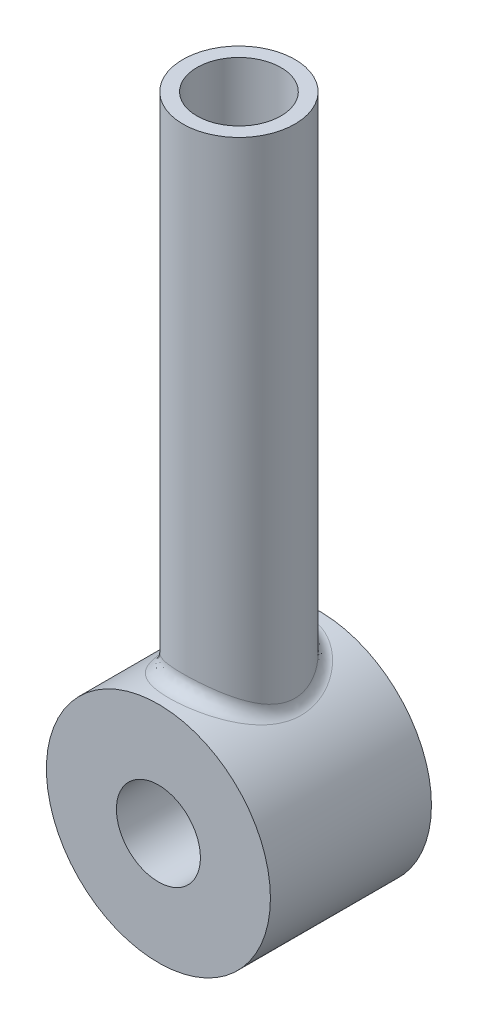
ISO-10303-21;
HEADER;
FILE_DESCRIPTION(('STEP AP214'),'2;1');
FILE_NAME('part.step','',(''),(''),'','','');
FILE_SCHEMA(('AUTOMOTIVE_DESIGN { 1 0 10303 214 1 1 1 1 }'));
ENDSEC;
DATA;
#1=APPLICATION_CONTEXT('core data for automotive mechanical design processes');
#2=APPLICATION_PROTOCOL_DEFINITION('international standard','automotive_design',2000,#1);
#3=PRODUCT_CONTEXT('',#1,'mechanical');
#4=PRODUCT('Part','Part','',(#3));
#5=PRODUCT_RELATED_PRODUCT_CATEGORY('part','',(#4));
#6=PRODUCT_DEFINITION_FORMATION('','',#4);
#7=PRODUCT_DEFINITION_CONTEXT('part definition',#1,'design');
#8=PRODUCT_DEFINITION('design','',#6,#7);
#9=PRODUCT_DEFINITION_SHAPE('','',#8);
#10=(LENGTH_UNIT() NAMED_UNIT(*) SI_UNIT(.MILLI.,.METRE.));
#11=(NAMED_UNIT(*) PLANE_ANGLE_UNIT() SI_UNIT($,.RADIAN.));
#12=(NAMED_UNIT(*) SI_UNIT($,.STERADIAN.) SOLID_ANGLE_UNIT());
#13=UNCERTAINTY_MEASURE_WITH_UNIT(LENGTH_MEASURE(1.E-05),#10,'distance_accuracy_value','');
#14=(GEOMETRIC_REPRESENTATION_CONTEXT(3) GLOBAL_UNCERTAINTY_ASSIGNED_CONTEXT((#13)) GLOBAL_UNIT_ASSIGNED_CONTEXT((#10,
#11,#12)) REPRESENTATION_CONTEXT('',''));
#15=CARTESIAN_POINT('',(0.,0.,0.));
#16=DIRECTION('',(0.,0.,1.));
#17=DIRECTION('',(1.,0.,0.));
#18=AXIS2_PLACEMENT_3D('',#15,#16,#17);
#19=CARTESIAN_POINT('',(0.,0.,11.5));
#20=DIRECTION('',(0.,0.,-1.));
#21=DIRECTION('',(-1.,0.,0.));
#22=AXIS2_PLACEMENT_3D('',#19,#20,#21);
#23=CYLINDRICAL_SURFACE('',#22,8.);
#24=CARTESIAN_POINT('',(-1.75121556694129,7.80597489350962,1.15449817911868));
#25=CARTESIAN_POINT('',(-1.40586063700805,7.88345284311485,2.00061853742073));
#26=CARTESIAN_POINT('',(-1.57609401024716,8.78172175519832,2.07359854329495));
#27=CARTESIAN_POINT('',(-1.63424459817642,7.83222354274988,1.09807547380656));
#28=CARTESIAN_POINT('',(-1.30540557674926,7.90053171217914,1.96335306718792));
#29=CARTESIAN_POINT('',(-1.47082013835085,8.81125148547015,2.02846037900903));
#30=CARTESIAN_POINT('',(-1.51475217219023,7.85626016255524,1.04714375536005));
#31=CARTESIAN_POINT('',(-1.20508992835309,7.91558956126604,1.93076368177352));
#32=CARTESIAN_POINT('',(-1.36327695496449,8.83829268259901,1.98771500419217));
#33=CARTESIAN_POINT('',(-1.27150965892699,7.89927045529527,0.956823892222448));
#34=CARTESIAN_POINT('',(-1.00382958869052,7.94199875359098,1.87385027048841));
#35=CARTESIAN_POINT('',(-1.14435869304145,8.88667926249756,1.91545911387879));
#36=CARTESIAN_POINT('',(-1.14776183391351,7.91824677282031,0.91742971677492));
#37=CARTESIAN_POINT('',(-0.903074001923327,7.95329276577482,1.84965217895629));
#38=CARTESIAN_POINT('',(-1.03298565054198,8.90802762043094,1.88394377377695));
#39=CARTESIAN_POINT('',(-0.897066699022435,7.95054890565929,0.85076612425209));
#40=CARTESIAN_POINT('',(-0.701402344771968,7.97222130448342,1.80917420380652));
#41=CARTESIAN_POINT('',(-0.807360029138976,8.94436751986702,1.83061289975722));
#42=CARTESIAN_POINT('',(-0.770121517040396,7.96387837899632,0.823488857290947));
#43=CARTESIAN_POINT('',(-0.600720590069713,7.97981035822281,1.79299215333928));
#44=CARTESIAN_POINT('',(-0.693109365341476,8.95936317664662,1.80879108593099));
#45=CARTESIAN_POINT('',(-0.514166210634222,7.98449473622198,0.781437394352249));
#46=CARTESIAN_POINT('',(-0.399295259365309,7.9914440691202,1.76820406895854));
#47=CARTESIAN_POINT('',(-0.462749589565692,8.98255657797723,1.77514991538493));
#48=CARTESIAN_POINT('',(-0.385156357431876,7.99178240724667,0.766661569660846));
#49=CARTESIAN_POINT('',(-0.298817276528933,7.99545757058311,1.75966452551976));
#50=CARTESIAN_POINT('',(-0.346640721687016,8.99075520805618,1.76332925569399));
#51=CARTESIAN_POINT('',(-0.0282131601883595,8.00317024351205,0.74355654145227));
#52=CARTESIAN_POINT('',(-0.0213022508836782,8.00178070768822,1.74621063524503));
#53=CARTESIAN_POINT('',(-0.0253918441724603,9.00356652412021,1.74484523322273));
#54=CARTESIAN_POINT('',(0.200763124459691,8.00069409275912,0.748548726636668));
#55=CARTESIAN_POINT('',(0.154624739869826,8.00045286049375,1.74903568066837));
#56=CARTESIAN_POINT('',(0.180686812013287,9.00078085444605,1.74883898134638));
#57=CARTESIAN_POINT('',(0.654139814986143,7.9764502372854,0.797808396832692));
#58=CARTESIAN_POINT('',(0.508496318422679,7.98693862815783,1.7777943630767));
#59=CARTESIAN_POINT('',(0.588725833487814,8.97350651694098,1.78824671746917));
#60=CARTESIAN_POINT('',(0.878540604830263,7.95468415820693,0.842072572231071));
#61=CARTESIAN_POINT('',(0.684920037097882,7.97486918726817,1.80347913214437));
#62=CARTESIAN_POINT('',(0.790686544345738,8.94901967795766,1.82365805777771));
#63=CARTESIAN_POINT('',(1.30918297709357,7.89504509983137,0.965527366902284));
#64=CARTESIAN_POINT('',(1.03325415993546,7.93958897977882,1.87900426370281));
#65=CARTESIAN_POINT('',(1.17826467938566,8.88192573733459,1.92242189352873));
#66=CARTESIAN_POINT('',(1.51578048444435,7.85773293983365,1.04350515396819));
#67=CARTESIAN_POINT('',(1.20390955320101,7.91702207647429,1.92745269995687));
#68=CARTESIAN_POINT('',(1.36420243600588,8.83994955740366,1.98480412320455));
#69=CARTESIAN_POINT('',(1.91433299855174,7.77026506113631,1.23103750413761));
#70=CARTESIAN_POINT('',(1.54314623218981,7.86073565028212,2.05011561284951));
#71=CARTESIAN_POINT('',(1.72289969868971,8.74154819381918,2.13483000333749));
#72=CARTESIAN_POINT('',(2.10628510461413,7.72010680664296,1.34059830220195));
#73=CARTESIAN_POINT('',(1.7110270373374,7.82733048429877,2.12361983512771));
#74=CARTESIAN_POINT('',(1.89565659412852,8.68512015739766,2.22247864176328));
#75=CARTESIAN_POINT('',(2.4881309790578,7.60606729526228,1.59874832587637));
#76=CARTESIAN_POINT('',(2.05378499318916,7.7472923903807,2.30464273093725));
#77=CARTESIAN_POINT('',(2.2393178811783,8.55682570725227,2.42899866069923));
#78=CARTESIAN_POINT('',(2.67641438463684,7.5413748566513,1.74989151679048));
#79=CARTESIAN_POINT('',(2.22806395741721,7.70004157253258,2.41382660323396));
#80=CARTESIAN_POINT('',(2.40877294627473,8.48404671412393,2.54991321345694));
#81=CARTESIAN_POINT('',(3.02903905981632,7.40679563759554,2.0819194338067));
#82=CARTESIAN_POINT('',(2.56175098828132,7.59732827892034,2.66310862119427));
#83=CARTESIAN_POINT('',(2.72613515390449,8.33264509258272,2.81553554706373));
#84=CARTESIAN_POINT('',(3.19335692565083,7.33690387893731,2.26283287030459));
#85=CARTESIAN_POINT('',(2.72143820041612,7.54205580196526,2.80250864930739));
#86=CARTESIAN_POINT('',(2.87402123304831,8.254016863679,2.96026629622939));
#87=CARTESIAN_POINT('',(3.51282681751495,7.18988022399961,2.67347521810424));
#88=CARTESIAN_POINT('',(3.03614005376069,7.42235039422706,3.12743226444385));
#89=CARTESIAN_POINT('',(3.16154413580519,8.08861525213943,3.2887801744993));
#90=CARTESIAN_POINT('',(3.66476839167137,7.11283688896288,2.90642273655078));
#91=CARTESIAN_POINT('',(3.18985021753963,7.35739066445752,3.31637407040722));
#92=CARTESIAN_POINT('',(3.29829155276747,8.00194150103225,3.47513818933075));
#93=CARTESIAN_POINT('',(3.93190755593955,6.96872958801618,3.40113730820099));
#94=CARTESIAN_POINT('',(3.46227094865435,7.23350675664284,3.72576304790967));
#95=CARTESIAN_POINT('',(3.5387168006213,7.83982078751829,3.87090984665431));
#96=CARTESIAN_POINT('',(4.04713349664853,6.90165794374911,3.66288191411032));
#97=CARTESIAN_POINT('',(3.58224456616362,7.17421234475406,3.94637069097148));
#98=CARTESIAN_POINT('',(3.64242014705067,7.76436518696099,4.08030553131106));
#99=CARTESIAN_POINT('',(4.21963933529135,6.79727736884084,4.16145951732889));
#100=CARTESIAN_POINT('',(3.76233455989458,7.08112271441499,4.37159312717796));
#101=CARTESIAN_POINT('',(3.79767540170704,7.64693703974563,4.47916761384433));
#102=CARTESIAN_POINT('',(4.28355653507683,6.75680497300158,4.39453793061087));
#103=CARTESIAN_POINT('',(3.82982925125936,7.04443940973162,4.57230368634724));
#104=CARTESIAN_POINT('',(3.85520088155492,7.60140559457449,4.66563034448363));
#105=CARTESIAN_POINT('',(4.38070542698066,6.69423827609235,4.87157617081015));
#106=CARTESIAN_POINT('',(3.93223554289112,6.98770314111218,4.98463883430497));
#107=CARTESIAN_POINT('',(3.9426348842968,7.53101806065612,5.04726093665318));
#108=CARTESIAN_POINT('',(4.41397292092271,6.67212253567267,5.11552295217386));
#109=CARTESIAN_POINT('',(3.96767449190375,6.96737058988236,5.19712928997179));
#110=CARTESIAN_POINT('',(3.97257562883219,7.5061378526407,5.24241836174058));
#111=CARTESIAN_POINT('',(4.44810802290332,6.6494209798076,5.60841669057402));
#112=CARTESIAN_POINT('',(4.00385058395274,6.94660562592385,5.62621662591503));
#113=CARTESIAN_POINT('',(4.00329722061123,7.48059860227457,5.63673335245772));
#114=CARTESIAN_POINT('',(4.44886700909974,6.6489073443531,5.8573776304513));
#115=CARTESIAN_POINT('',(4.00466189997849,6.94613062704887,5.84394108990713));
#116=CARTESIAN_POINT('',(4.00398030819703,7.48002076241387,5.83590210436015));
#117=CARTESIAN_POINT('',(4.41765659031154,6.66967963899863,6.35155535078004));
#118=CARTESIAN_POINT('',(3.97158058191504,6.96513545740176,6.27421861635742));
#119=CARTESIAN_POINT('',(3.97589093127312,7.50338959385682,6.23124428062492));
#120=CARTESIAN_POINT('',(4.38567418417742,6.69097422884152,6.59677060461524));
#121=CARTESIAN_POINT('',(3.93749945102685,6.98472362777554,6.48789228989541));
#122=CARTESIAN_POINT('',(3.94710676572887,7.52734600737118,6.42741648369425));
#123=CARTESIAN_POINT('',(4.2930050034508,6.7507720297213,7.06515285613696));
#124=CARTESIAN_POINT('',(3.83980208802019,7.03896557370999,6.89284907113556));
#125=CARTESIAN_POINT('',(3.86370450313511,7.59461853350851,6.8021222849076));
#126=CARTESIAN_POINT('',(4.23371344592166,6.78843425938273,7.28881507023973));
#127=CARTESIAN_POINT('',(3.77717878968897,7.07311926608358,7.0855809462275));
#128=CARTESIAN_POINT('',(3.81034210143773,7.63698854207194,6.98105205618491));
#129=CARTESIAN_POINT('',(4.0893661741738,6.8763506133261,7.72195852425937));
#130=CARTESIAN_POINT('',(3.62650560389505,7.1515841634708,7.45512184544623));
#131=CARTESIAN_POINT('',(3.68042955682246,7.73589444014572,7.32756681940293));
#132=CARTESIAN_POINT('',(4.00430155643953,6.92660908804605,7.93143483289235));
#133=CARTESIAN_POINT('',(3.53787507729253,7.19616118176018,7.63242677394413));
#134=CARTESIAN_POINT('',(3.6038714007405,7.79243522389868,7.49514786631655));
#135=CARTESIAN_POINT('',(3.79840554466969,7.04185362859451,8.35884290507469));
#136=CARTESIAN_POINT('',(3.32616251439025,7.29649407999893,7.98982320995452));
#137=CARTESIAN_POINT('',(3.41856499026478,7.92208533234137,7.83707432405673));
#138=CARTESIAN_POINT('',(3.67440628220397,7.10789913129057,8.57447776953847));
#139=CARTESIAN_POINT('',(3.19952646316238,7.35313396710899,8.16730668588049));
#140=CARTESIAN_POINT('',(3.3069656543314,7.99638652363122,8.00958221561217));
#141=CARTESIAN_POINT('',(3.39930228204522,7.24349965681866,8.98121999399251));
#142=CARTESIAN_POINT('',(2.924160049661,7.46629595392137,8.49578675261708));
#143=CARTESIAN_POINT('',(3.05937205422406,8.1489371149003,8.33497599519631));
#144=CARTESIAN_POINT('',(3.24817378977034,7.31305771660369,9.17230560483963));
#145=CARTESIAN_POINT('',(2.77464117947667,7.5229435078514,8.64658300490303));
#146=CARTESIAN_POINT('',(2.92335641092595,8.22718993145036,8.48784448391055));
#147=CARTESIAN_POINT('',(2.89904695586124,7.45895094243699,9.5509441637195));
#148=CARTESIAN_POINT('',(2.43704942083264,7.63806921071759,8.93879302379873));
#149=CARTESIAN_POINT('',(2.60914226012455,8.39131980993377,8.7907553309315));
#150=CARTESIAN_POINT('',(2.69747499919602,7.53493232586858,9.73453309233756));
#151=CARTESIAN_POINT('',(2.24641065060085,7.69543246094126,9.07491024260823));
#152=CARTESIAN_POINT('',(2.42772749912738,8.47679886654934,8.9376264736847));
#153=CARTESIAN_POINT('',(2.26630084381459,7.67562090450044,10.061018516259));
#154=CARTESIAN_POINT('',(1.85199389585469,7.79717813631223,9.30952733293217));
#155=CARTESIAN_POINT('',(2.03967075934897,8.63507351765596,9.19881481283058));
#156=CARTESIAN_POINT('',(2.03671938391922,7.74033635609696,10.2039448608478));
#157=CARTESIAN_POINT('',(1.64834261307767,7.84110988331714,9.40679176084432));
#158=CARTESIAN_POINT('',(1.83304744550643,8.70787840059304,9.31315588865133));
#159=CARTESIAN_POINT('',(1.59179335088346,7.84283734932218,10.4250577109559));
#160=CARTESIAN_POINT('',(1.26738989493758,7.907789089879,9.55261423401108));
#161=CARTESIAN_POINT('',(1.4326140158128,8.82319201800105,9.49004616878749));
#162=CARTESIAN_POINT('',(1.37962168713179,7.88322528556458,10.5097949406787));
#163=CARTESIAN_POINT('',(1.09103121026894,7.9324550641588,9.60566689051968));
#164=CARTESIAN_POINT('',(1.24165951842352,8.86862844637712,9.55783595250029));
#165=CARTESIAN_POINT('',(0.94397895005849,7.94715311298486,10.6424969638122));
#166=CARTESIAN_POINT('',(0.737077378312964,7.97055725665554,9.68733119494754));
#167=CARTESIAN_POINT('',(0.849581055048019,8.94054725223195,9.66399757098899));
#168=CARTESIAN_POINT('',(0.720516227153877,7.97070526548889,10.6904885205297));
#169=CARTESIAN_POINT('',(0.560675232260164,7.98371588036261,9.71534298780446));
#170=CARTESIAN_POINT('',(0.648464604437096,8.96704342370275,9.7023908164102));
#171=CARTESIAN_POINT('',(0.271441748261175,7.99851601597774,10.7470494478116));
#172=CARTESIAN_POINT('',(0.209388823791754,7.99926911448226,9.74844607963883));
#173=CARTESIAN_POINT('',(0.244297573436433,8.99833051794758,9.74763955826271));
#174=CARTESIAN_POINT('',(0.04589635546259,8.00302299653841,10.7561263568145));
#175=CARTESIAN_POINT('',(0.0359508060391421,8.00167355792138,9.75355838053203));
#176=CARTESIAN_POINT('',(0.0413067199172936,9.00340087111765,9.75490108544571));
#177=CARTESIAN_POINT('',(-0.403403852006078,7.99298239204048,10.7357822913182));
#178=CARTESIAN_POINT('',(-0.312738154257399,7.99613336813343,9.74177611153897));
#179=CARTESIAN_POINT('',(-0.363063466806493,8.99210519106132,9.73862583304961));
#180=CARTESIAN_POINT('',(-0.627158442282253,7.97843245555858,10.7063565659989));
#181=CARTESIAN_POINT('',(-0.486493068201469,7.98823441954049,9.72497869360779));
#182=CARTESIAN_POINT('',(-0.564442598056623,8.9757365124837,9.7150852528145));
#183=CARTESIAN_POINT('',(-1.06580764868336,7.93174874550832,10.6105955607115));
#184=CARTESIAN_POINT('',(-0.835474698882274,7.96137131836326,9.66766201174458));
#185=CARTESIAN_POINT('',(-0.959226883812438,8.92321733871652,9.63847644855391));
#186=CARTESIAN_POINT('',(-1.2807215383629,7.89965567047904,10.544345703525));
#187=CARTESIAN_POINT('',(-1.00938510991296,7.9426439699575,9.62764939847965));
#188=CARTESIAN_POINT('',(-1.15264938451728,8.88711262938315,9.5854765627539));
#189=CARTESIAN_POINT('',(-1.69698124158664,7.82081780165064,10.3778655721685));
#190=CARTESIAN_POINT('',(-1.35664796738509,7.89355242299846,9.52157884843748));
#191=CARTESIAN_POINT('',(-1.52728311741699,8.79842002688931,9.45229245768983));
#192=CARTESIAN_POINT('',(-1.89832310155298,7.77406876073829,10.2776254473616));
#193=CARTESIAN_POINT('',(-1.52908265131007,7.86350351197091,9.45621642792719));
#194=CARTESIAN_POINT('',(-1.70849079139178,8.74582735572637,9.3721003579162));
#195=CARTESIAN_POINT('',(-2.29223320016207,7.66741182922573,10.0413761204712));
#196=CARTESIAN_POINT('',(-1.8762110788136,7.79086053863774,9.29450105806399));
#197=CARTESIAN_POINT('',(-2.06300988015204,8.62583830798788,9.18310089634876));
#198=CARTESIAN_POINT('',(-2.48398995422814,7.60700348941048,9.9039514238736));
#199=CARTESIAN_POINT('',(-2.05035419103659,7.74808875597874,9.19767814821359));
#200=CARTESIAN_POINT('',(-2.23559095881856,8.55787892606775,9.07316113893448));
#201=CARTESIAN_POINT('',(-2.84543558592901,7.47932222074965,9.59934389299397));
#202=CARTESIAN_POINT('',(-2.38665763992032,7.65322257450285,8.97393469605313));
#203=CARTESIAN_POINT('',(-2.56089202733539,8.41423749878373,8.82947511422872));
#204=CARTESIAN_POINT('',(-3.01511004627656,7.4120448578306,9.43214178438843));
#205=CARTESIAN_POINT('',(-2.54890934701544,7.60137491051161,8.84777006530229));
#206=CARTESIAN_POINT('',(-2.71359904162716,8.33855046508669,8.69571342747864));
#207=CARTESIAN_POINT('',(-3.26062202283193,7.30599835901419,9.15064684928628));
#208=CARTESIAN_POINT('',(-2.78883161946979,7.51644091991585,8.62774694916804));
#209=CARTESIAN_POINT('',(-2.93455982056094,8.21924815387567,8.47051747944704));
#210=CARTESIAN_POINT('',(-3.34495490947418,7.26767943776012,9.04534887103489));
#211=CARTESIAN_POINT('',(-2.87185229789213,7.48535119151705,8.54473094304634));
#212=CARTESIAN_POINT('',(-3.01045941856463,8.17613936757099,8.38627909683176));
#213=CARTESIAN_POINT('',(-3.50540004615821,7.19166484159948,8.82705696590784));
#214=CARTESIAN_POINT('',(-3.03108982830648,7.42277094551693,8.37040113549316));
#215=CARTESIAN_POINT('',(-3.15486004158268,8.09062294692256,8.21164557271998));
#216=CARTESIAN_POINT('',(-3.58151983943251,7.15396862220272,8.71407025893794));
#217=CARTESIAN_POINT('',(-3.10743373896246,7.3912686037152,8.27914340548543));
#218=CARTESIAN_POINT('',(-3.22336785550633,8.04821470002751,8.12125620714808));
#219=CARTESIAN_POINT('',(-3.79721641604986,7.04324038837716,8.36375594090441));
#220=CARTESIAN_POINT('',(-3.32401716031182,7.29808347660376,7.99456792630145));
#221=CARTESIAN_POINT('',(-3.41749477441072,7.92364543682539,7.84100475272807));
#222=CARTESIAN_POINT('',(-3.92409127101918,6.97258645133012,8.11511892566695));
#223=CARTESIAN_POINT('',(-3.45490919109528,7.23655277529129,7.78747988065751));
#224=CARTESIAN_POINT('',(-3.5316821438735,7.84415975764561,7.64209514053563));
#225=CARTESIAN_POINT('',(-4.08645762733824,6.87785702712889,7.72146793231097));
#226=CARTESIAN_POINT('',(-3.62373515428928,7.15276308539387,7.45383567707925));
#227=CARTESIAN_POINT('',(-3.67781186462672,7.73758915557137,7.32717434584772));
#228=CARTESIAN_POINT('',(-4.13625421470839,6.84792905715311,7.58541932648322));
#229=CARTESIAN_POINT('',(-3.67567042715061,7.12611876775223,7.33814442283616));
#230=CARTESIAN_POINT('',(-3.72262879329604,7.70392018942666,7.21833546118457));
#231=CARTESIAN_POINT('',(-4.22527713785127,6.79336096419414,7.30774538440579));
#232=CARTESIAN_POINT('',(-3.76870321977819,7.07732110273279,7.10088034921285));
#233=CARTESIAN_POINT('',(-3.80274942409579,7.64253108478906,6.99619630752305));
#234=CARTESIAN_POINT('',(-4.26451060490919,6.76871727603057,7.16612388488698));
#235=CARTESIAN_POINT('',(-3.80995286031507,7.05509708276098,6.97917563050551));
#236=CARTESIAN_POINT('',(-3.83805954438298,7.6148069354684,6.88289910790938));
#237=CARTESIAN_POINT('',(-4.33176114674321,6.72587838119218,6.87857977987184));
#238=CARTESIAN_POINT('',(-3.88071241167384,7.01636731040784,6.73126930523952));
#239=CARTESIAN_POINT('',(-3.89858503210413,7.56661317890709,6.65286382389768));
#240=CARTESIAN_POINT('',(-4.35979543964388,6.70767328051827,6.73266415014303));
#241=CARTESIAN_POINT('',(-3.91036159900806,6.99979017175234,6.60489229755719));
#242=CARTESIAN_POINT('',(-3.92381589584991,7.54613244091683,6.53613132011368));
#243=CARTESIAN_POINT('',(-4.40421150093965,6.67859514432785,6.43769682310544));
#244=CARTESIAN_POINT('',(-3.95731409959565,6.97329990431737,6.34900118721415));
#245=CARTESIAN_POINT('',(-3.96379035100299,7.5134195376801,6.30015745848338));
#246=CARTESIAN_POINT('',(-4.42059587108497,6.66772047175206,6.28864583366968));
#247=CARTESIAN_POINT('',(-3.97470670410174,6.96333753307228,6.219265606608));
#248=CARTESIAN_POINT('',(-3.97853628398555,7.50118553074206,6.18091666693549));
#249=CARTESIAN_POINT('',(-4.4397949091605,6.65494748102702,6.01178889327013));
#250=CARTESIAN_POINT('',(-3.99506056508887,6.9516481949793,5.97820751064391));
#251=CARTESIAN_POINT('',(-3.99581541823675,7.4868159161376,5.95943111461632));
#252=CARTESIAN_POINT('',(-4.44429150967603,6.65193740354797,5.88419144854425));
#253=CARTESIAN_POINT('',(-3.99983791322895,6.94888567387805,5.86693952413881));
#254=CARTESIAN_POINT('',(-3.99986235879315,7.48342957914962,5.85735315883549));
#255=CARTESIAN_POINT('',(-4.44458972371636,6.6517384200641,5.6289327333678));
#256=CARTESIAN_POINT('',(-4.00015396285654,6.94870359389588,5.64449992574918));
#257=CARTESIAN_POINT('',(-4.0001307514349,7.48320572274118,5.65314618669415));
#258=CARTESIAN_POINT('',(-4.44038862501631,6.65455132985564,5.50127145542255));
#259=CARTESIAN_POINT('',(-3.99569022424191,6.95128544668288,5.5331726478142));
#260=CARTESIAN_POINT('',(-3.99634976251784,7.4863702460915,5.55101716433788));
#261=CARTESIAN_POINT('',(-4.42335171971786,6.66588811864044,5.24703591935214));
#262=CARTESIAN_POINT('',(-3.9776310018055,6.96165914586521,5.31182495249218));
#263=CARTESIAN_POINT('',(-3.98101654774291,7.49912413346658,5.34762873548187));
#264=CARTESIAN_POINT('',(-4.41051804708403,6.67441058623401,5.12046140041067));
#265=CARTESIAN_POINT('',(-3.9640127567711,6.96946402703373,5.20165265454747));
#266=CARTESIAN_POINT('',(-3.96946624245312,7.50871190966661,5.24636912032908));
#267=CARTESIAN_POINT('',(-4.37642298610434,6.69681476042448,4.8693489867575));
#268=CARTESIAN_POINT('',(-3.92794901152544,6.98989517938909,4.98362183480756));
#269=CARTESIAN_POINT('',(-3.93878068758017,7.53391660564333,5.04547918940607));
#270=CARTESIAN_POINT('',(-4.35515819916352,6.71069862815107,4.74481193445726));
#271=CARTESIAN_POINT('',(-3.90545173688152,7.00255021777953,4.87562540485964));
#272=CARTESIAN_POINT('',(-3.91964237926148,7.54953595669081,4.94584954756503));
#273=CARTESIAN_POINT('',(-4.28281910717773,6.7572656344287,4.39354274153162));
#274=CARTESIAN_POINT('',(-3.82906096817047,7.04484933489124,4.57155330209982));
#275=CARTESIAN_POINT('',(-3.85453719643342,7.60192383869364,4.66483419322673));
#276=CARTESIAN_POINT('',(-4.22179201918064,6.79588079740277,4.17029140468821));
#277=CARTESIAN_POINT('',(-3.76465557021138,7.07982390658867,4.3793370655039));
#278=CARTESIAN_POINT('',(-3.79961281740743,7.64536589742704,4.486233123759));
#279=CARTESIAN_POINT('',(-4.07408029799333,6.88543867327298,3.73835894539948));
#280=CARTESIAN_POINT('',(-3.61060234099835,7.15964494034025,4.0112175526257));
#281=CARTESIAN_POINT('',(-3.66667226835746,7.74611850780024,4.14068715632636));
#282=CARTESIAN_POINT('',(-3.98738807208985,6.93638503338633,3.52968215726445));
#283=CARTESIAN_POINT('',(-3.52036760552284,7.20475681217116,3.83483623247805));
#284=CARTESIAN_POINT('',(-3.58864926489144,7.80343316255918,3.97374572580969));
#285=CARTESIAN_POINT('',(-3.77769289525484,7.05302987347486,3.10326985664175));
#286=CARTESIAN_POINT('',(-3.30499956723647,7.3061157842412,3.47883009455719));
#287=CARTESIAN_POINT('',(-3.39992360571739,7.93465860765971,3.63261588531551));
#288=CARTESIAN_POINT('',(-3.65141912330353,7.11978678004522,2.88793493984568));
#289=CARTESIAN_POINT('',(-3.17623739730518,7.36322010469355,3.30196285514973));
#290=CARTESIAN_POINT('',(-3.28627721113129,8.00976012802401,3.46034795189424));
#291=CARTESIAN_POINT('',(-3.37165281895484,7.25645961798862,2.48222856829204));
#292=CARTESIAN_POINT('',(-2.89673719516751,7.47693289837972,2.97512554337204));
#293=CARTESIAN_POINT('',(-3.03448753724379,8.16351707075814,3.13578285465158));
#294=CARTESIAN_POINT('',(-3.21813827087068,7.32637807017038,2.29187752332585));
#295=CARTESIAN_POINT('',(-2.74521338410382,7.53365531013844,2.82538336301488));
#296=CARTESIAN_POINT('',(-2.89632444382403,8.24217532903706,2.98350201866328));
#297=CARTESIAN_POINT('',(-2.86447476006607,7.47235070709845,1.91598177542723));
#298=CARTESIAN_POINT('',(-2.40417505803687,7.64833887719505,2.53633088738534));
#299=CARTESIAN_POINT('',(-2.57802728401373,8.40639454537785,2.68278542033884));
#300=CARTESIAN_POINT('',(-2.66084891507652,7.54800450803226,1.7343525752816));
#301=CARTESIAN_POINT('',(-2.21222435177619,7.70513949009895,2.40227163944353));
#302=CARTESIAN_POINT('',(-2.39476402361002,8.49150507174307,2.5374820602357));
#303=CARTESIAN_POINT('',(-2.22549692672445,7.6875993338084,1.41211750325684));
#304=CARTESIAN_POINT('',(-1.81545469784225,7.8055108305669,2.17179241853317));
#305=CARTESIAN_POINT('',(-2.00294723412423,8.64854925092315,2.27969400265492));
#306=CARTESIAN_POINT('',(-1.9937776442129,7.75154320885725,1.27150164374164));
#307=CARTESIAN_POINT('',(-1.61081447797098,7.84860761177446,2.07664956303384));
#308=CARTESIAN_POINT('',(-1.79439987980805,8.72048611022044,2.16720131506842));
#309=CARTESIAN_POINT('',(-1.75121556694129,7.80597489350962,1.15449817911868));
#310=CARTESIAN_POINT('',(-1.40586063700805,7.88345284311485,2.00061853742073));
#311=CARTESIAN_POINT('',(-1.57609401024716,8.78172175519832,2.07359854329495));
#312=(BOUNDED_SURFACE() B_SPLINE_SURFACE(3,2,((#24,#25,#26),(#27,#28,#29),(#30,#31,#32),(#33,
#34,#35),(#36,#37,#38),(#39,#40,#41),(#42,#43,#44),(#45,#46,#47),(#48,#49,#50),(#51,#52,#53),
(#54,#55,#56),(#57,#58,#59),(#60,#61,#62),(#63,#64,#65),(#66,#67,#68),(#69,#70,#71),(#72,#73,
#74),(#75,#76,#77),(#78,#79,#80),(#81,#82,#83),(#84,#85,#86),(#87,#88,#89),(#90,#91,#92),(#93,
#94,#95),(#96,#97,#98),(#99,#100,#101),(#102,#103,#104),(#105,#106,#107),(#108,#109,#110),(#111,
#112,#113),(#114,#115,#116),(#117,#118,#119),(#120,#121,#122),(#123,#124,#125),(#126,#127,#128),
(#129,#130,#131),(#132,#133,#134),(#135,#136,#137),(#138,#139,#140),(#141,#142,#143),(#144,#145,
#146),(#147,#148,#149),(#150,#151,#152),(#153,#154,#155),(#156,#157,#158),(#159,#160,#161),
(#162,#163,#164),(#165,#166,#167),(#168,#169,#170),(#171,#172,#173),(#174,#175,#176),(#177,#178,
#179),(#180,#181,#182),(#183,#184,#185),(#186,#187,#188),(#189,#190,#191),(#192,#193,#194),
(#195,#196,#197),(#198,#199,#200),(#201,#202,#203),(#204,#205,#206),(#207,#208,#209),(#210,#211,
#212),(#213,#214,#215),(#216,#217,#218),(#219,#220,#221),(#222,#223,#224),(#225,#226,#227),
(#228,#229,#230),(#231,#232,#233),(#234,#235,#236),(#237,#238,#239),(#240,#241,#242),(#243,#244,
#245),(#246,#247,#248),(#249,#250,#251),(#252,#253,#254),(#255,#256,#257),(#258,#259,#260),
(#261,#262,#263),(#264,#265,#266),(#267,#268,#269),(#270,#271,#272),(#273,#274,#275),(#276,#277,
#278),(#279,#280,#281),(#282,#283,#284),(#285,#286,#287),(#288,#289,#290),(#291,#292,#293),
(#294,#295,#296),(#297,#298,#299),(#300,#301,#302),(#303,#304,#305),(#306,#307,#308),(#309,#310,
#311)),.UNSPECIFIED.,.T.,.F.,.F.) B_SPLINE_SURFACE_WITH_KNOTS((4,2,2,2,2,2,2,2,2,2,2,2,2,2,2,2,
2,2,2,2,2,2,2,2,2,2,2,2,2,2,2,2,2,2,2,2,2,2,2,2,2,2,2,2,2,2,2,4),(3,3),(0.,0.438293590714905,
0.876357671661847,1.31413753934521,1.7518603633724,2.5205446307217,3.28916412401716,
4.03217443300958,4.77533152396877,5.58268910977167,6.39082992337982,7.2916187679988,
8.1917103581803,8.93296847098,9.67335962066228,10.4162244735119,11.1593844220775,
11.8681913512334,12.5772434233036,13.3762198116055,14.1758992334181,15.083601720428,
15.9906361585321,16.7592693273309,17.5273421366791,18.2853664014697,19.043484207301,
19.7998506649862,20.5564365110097,21.3473199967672,22.1387172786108,22.5827024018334,
23.0262762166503,23.9136192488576,24.3658924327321,24.8178595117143,25.2691290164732,
25.7202977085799,26.1029999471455,26.485821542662,26.8685485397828,27.2514299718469,
27.961044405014,28.6708689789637,29.4737767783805,30.277336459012,31.1864451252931,
32.0953322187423),(0.,1.),
.UNSPECIFIED.) GEOMETRIC_REPRESENTATION_ITEM() RATIONAL_B_SPLINE_SURFACE(((1.,0.736971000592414,
1.),(1.,0.733061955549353,1.),(1.,0.729430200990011,1.),(1.,0.722868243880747,1.),(1.,
0.719937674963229,1.),(1.,0.714914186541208,1.),(1.,0.712820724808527,1.),(1.,0.709569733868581,
1.),(1.,0.708412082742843,1.),(1.,0.7066048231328,1.),(1.,0.707001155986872,1.),(1.,
0.710841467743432,1.),(1.,0.714285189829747,1.),(1.,0.723527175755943,1.),(1.,0.729243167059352,
1.),(1.,0.742305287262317,1.),(1.,0.749651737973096,1.),(1.,0.765880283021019,1.),(1.,
0.774840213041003,1.),(1.,0.792885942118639,1.),(1.,0.80197185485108,1.),(1.,0.820504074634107,
1.),(1.,0.829872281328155,1.),(1.,0.846892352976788,1.),(1.,0.854545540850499,1.),(1.,
0.866216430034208,1.),(1.,0.870637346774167,1.),(1.,0.877408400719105,1.),(1.,0.879760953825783,
1.),(1.,0.8821752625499,1.),(1.,0.882229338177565,1.),(1.,0.880021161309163,1.),(1.,
0.877757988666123,1.),(1.,0.871293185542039,1.),(1.,0.867185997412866,1.),(1.,0.857389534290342,
1.),(1.,0.851699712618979,1.),(1.,0.838316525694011,1.),(1.,0.83046058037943,1.),(1.,
0.813817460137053,1.),(1.,0.805029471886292,1.),(1.,0.786005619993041,1.),(1.,0.775734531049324,
1.),(1.,0.756090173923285,1.),(1.,0.746716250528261,1.),(1.,0.73150244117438,1.),(1.,
0.725341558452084,1.),(1.,0.715465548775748,1.),(1.,0.711748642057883,1.),(1.,0.707348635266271,
1.),(1.,0.706626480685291,1.),(1.,0.708222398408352,1.),(1.,0.710540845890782,1.),(1.,
0.717851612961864,1.),(1.,0.722837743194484,1.),(1.,0.734793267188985,1.),(1.,0.741763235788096,
1.),(1.,0.757218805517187,1.),(1.,0.765758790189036,1.),(1.,0.78324542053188,1.),(1.,
0.792192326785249,1.),(1.,0.805867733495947,1.),(1.,0.810723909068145,1.),(1.,0.820200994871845,
1.),(1.,0.824822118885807,1.),(1.,0.83818391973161,1.),(1.,0.846420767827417,1.),(1.,
0.857206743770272,1.),(1.,0.860564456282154,1.),(1.,0.866624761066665,1.),(1.,0.869327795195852,
1.),(1.,0.873991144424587,1.),(1.,0.87595259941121,1.),(1.,0.879071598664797,1.),(1.,
0.880229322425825,1.),(1.,0.881587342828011,1.),(1.,0.881906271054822,1.),(1.,0.881927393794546,
1.),(1.,0.881629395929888,1.),(1.,0.880424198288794,1.),(1.,0.879517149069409,1.),(1.,
0.877118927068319,1.),(1.,0.875627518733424,1.),(1.,0.870586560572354,1.),(1.,0.866366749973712,
1.),(1.,0.856364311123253,1.),(1.,0.850581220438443,1.),(1.,0.836996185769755,1.),(1.,
0.829028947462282,1.),(1.,0.812193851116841,1.),(1.,0.803325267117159,1.),(1.,0.784214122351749,
1.),(1.,0.773944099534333,1.),(1.,0.754375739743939,1.),(1.,0.745077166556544,1.),(1.,
0.736971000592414,1.))) REPRESENTATION_ITEM('') SURFACE());
#313=CARTESIAN_POINT('',(-1.75121556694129,7.80597489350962,1.15449817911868));
#314=CARTESIAN_POINT('',(-1.63424459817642,7.83222354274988,1.09807547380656));
#315=CARTESIAN_POINT('',(-1.51475217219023,7.85626016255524,1.04714375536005));
#316=CARTESIAN_POINT('',(-1.27150965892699,7.89927045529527,0.956823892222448));
#317=CARTESIAN_POINT('',(-1.14776183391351,7.91824677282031,0.91742971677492));
#318=CARTESIAN_POINT('',(-0.897066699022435,7.95054890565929,0.85076612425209));
#319=CARTESIAN_POINT('',(-0.770121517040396,7.96387837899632,0.823488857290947));
#320=CARTESIAN_POINT('',(-0.514166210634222,7.98449473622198,0.781437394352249));
#321=CARTESIAN_POINT('',(-0.385156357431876,7.99178240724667,0.766661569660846));
#322=CARTESIAN_POINT('',(-0.0282131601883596,8.00317024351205,0.74355654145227));
#323=CARTESIAN_POINT('',(0.200763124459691,8.00069409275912,0.748548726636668));
#324=CARTESIAN_POINT('',(0.654139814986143,7.9764502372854,0.797808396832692));
#325=CARTESIAN_POINT('',(0.878540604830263,7.95468415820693,0.842072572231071));
#326=CARTESIAN_POINT('',(1.30918297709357,7.89504509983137,0.965527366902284));
#327=CARTESIAN_POINT('',(1.51578048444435,7.85773293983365,1.04350515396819));
#328=CARTESIAN_POINT('',(1.91433299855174,7.7702650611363,1.23103750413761));
#329=CARTESIAN_POINT('',(2.10628510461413,7.72010680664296,1.34059830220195));
#330=CARTESIAN_POINT('',(2.4881309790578,7.60606729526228,1.59874832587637));
#331=CARTESIAN_POINT('',(2.67641438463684,7.5413748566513,1.74989151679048));
#332=CARTESIAN_POINT('',(3.02903905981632,7.40679563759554,2.0819194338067));
#333=CARTESIAN_POINT('',(3.19335692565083,7.33690387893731,2.26283287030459));
#334=CARTESIAN_POINT('',(3.51282681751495,7.18988022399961,2.67347521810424));
#335=CARTESIAN_POINT('',(3.66476839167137,7.11283688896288,2.90642273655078));
#336=CARTESIAN_POINT('',(3.93190755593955,6.96872958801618,3.40113730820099));
#337=CARTESIAN_POINT('',(4.04713349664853,6.90165794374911,3.66288191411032));
#338=CARTESIAN_POINT('',(4.21963933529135,6.79727736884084,4.16145951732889));
#339=CARTESIAN_POINT('',(4.28355653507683,6.75680497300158,4.39453793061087));
#340=CARTESIAN_POINT('',(4.38070542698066,6.69423827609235,4.87157617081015));
#341=CARTESIAN_POINT('',(4.41397292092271,6.67212253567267,5.11552295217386));
#342=CARTESIAN_POINT('',(4.44810802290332,6.6494209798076,5.60841669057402));
#343=CARTESIAN_POINT('',(4.44886700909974,6.6489073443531,5.8573776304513));
#344=CARTESIAN_POINT('',(4.41765659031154,6.66967963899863,6.35155535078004));
#345=CARTESIAN_POINT('',(4.38567418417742,6.69097422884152,6.59677060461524));
#346=CARTESIAN_POINT('',(4.2930050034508,6.7507720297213,7.06515285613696));
#347=CARTESIAN_POINT('',(4.23371344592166,6.78843425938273,7.28881507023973));
#348=CARTESIAN_POINT('',(4.0893661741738,6.8763506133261,7.72195852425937));
#349=CARTESIAN_POINT('',(4.00430155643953,6.92660908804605,7.93143483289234));
#350=CARTESIAN_POINT('',(3.79840554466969,7.04185362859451,8.35884290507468));
#351=CARTESIAN_POINT('',(3.67440628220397,7.10789913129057,8.57447776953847));
#352=CARTESIAN_POINT('',(3.39930228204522,7.24349965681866,8.98121999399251));
#353=CARTESIAN_POINT('',(3.24817378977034,7.31305771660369,9.17230560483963));
#354=CARTESIAN_POINT('',(2.89904695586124,7.45895094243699,9.5509441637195));
#355=CARTESIAN_POINT('',(2.69747499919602,7.53493232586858,9.73453309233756));
#356=CARTESIAN_POINT('',(2.26630084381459,7.67562090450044,10.061018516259));
#357=CARTESIAN_POINT('',(2.03671938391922,7.74033635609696,10.2039448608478));
#358=CARTESIAN_POINT('',(1.59179335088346,7.84283734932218,10.4250577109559));
#359=CARTESIAN_POINT('',(1.37962168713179,7.88322528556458,10.5097949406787));
#360=CARTESIAN_POINT('',(0.943978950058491,7.94715311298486,10.6424969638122));
#361=CARTESIAN_POINT('',(0.720516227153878,7.97070526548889,10.6904885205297));
#362=CARTESIAN_POINT('',(0.271441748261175,7.99851601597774,10.7470494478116));
#363=CARTESIAN_POINT('',(0.0458963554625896,8.00302299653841,10.7561263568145));
#364=CARTESIAN_POINT('',(-0.403403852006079,7.99298239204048,10.7357822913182));
#365=CARTESIAN_POINT('',(-0.627158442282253,7.97843245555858,10.7063565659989));
#366=CARTESIAN_POINT('',(-1.06580764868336,7.93174874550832,10.6105955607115));
#367=CARTESIAN_POINT('',(-1.2807215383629,7.89965567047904,10.544345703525));
#368=CARTESIAN_POINT('',(-1.69698124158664,7.82081780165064,10.3778655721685));
#369=CARTESIAN_POINT('',(-1.89832310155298,7.77406876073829,10.2776254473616));
#370=CARTESIAN_POINT('',(-2.29223320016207,7.66741182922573,10.0413761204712));
#371=CARTESIAN_POINT('',(-2.48398995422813,7.60700348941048,9.9039514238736));
#372=CARTESIAN_POINT('',(-2.84543558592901,7.47932222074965,9.59934389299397));
#373=CARTESIAN_POINT('',(-3.01511004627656,7.4120448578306,9.43214178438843));
#374=CARTESIAN_POINT('',(-3.26062202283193,7.30599835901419,9.15064684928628));
#375=CARTESIAN_POINT('',(-3.34495490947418,7.26767943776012,9.04534887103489));
#376=CARTESIAN_POINT('',(-3.50540004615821,7.19166484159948,8.82705696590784));
#377=CARTESIAN_POINT('',(-3.58151983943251,7.15396862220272,8.71407025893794));
#378=CARTESIAN_POINT('',(-3.79721641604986,7.04324038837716,8.36375594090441));
#379=CARTESIAN_POINT('',(-3.92409127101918,6.97258645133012,8.11511892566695));
#380=CARTESIAN_POINT('',(-4.08645762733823,6.87785702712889,7.72146793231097));
#381=CARTESIAN_POINT('',(-4.13625421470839,6.84792905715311,7.58541932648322));
#382=CARTESIAN_POINT('',(-4.22527713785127,6.79336096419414,7.30774538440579));
#383=CARTESIAN_POINT('',(-4.26451060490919,6.76871727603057,7.16612388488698));
#384=CARTESIAN_POINT('',(-4.33176114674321,6.72587838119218,6.87857977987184));
#385=CARTESIAN_POINT('',(-4.35979543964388,6.70767328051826,6.73266415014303));
#386=CARTESIAN_POINT('',(-4.40421150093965,6.67859514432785,6.43769682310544));
#387=CARTESIAN_POINT('',(-4.42059587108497,6.66772047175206,6.28864583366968));
#388=CARTESIAN_POINT('',(-4.4397949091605,6.65494748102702,6.01178889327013));
#389=CARTESIAN_POINT('',(-4.44429150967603,6.65193740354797,5.88419144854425));
#390=CARTESIAN_POINT('',(-4.44458972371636,6.6517384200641,5.6289327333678));
#391=CARTESIAN_POINT('',(-4.44038862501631,6.65455132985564,5.50127145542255));
#392=CARTESIAN_POINT('',(-4.42335171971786,6.66588811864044,5.24703591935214));
#393=CARTESIAN_POINT('',(-4.41051804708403,6.67441058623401,5.12046140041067));
#394=CARTESIAN_POINT('',(-4.37642298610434,6.69681476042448,4.8693489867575));
#395=CARTESIAN_POINT('',(-4.35515819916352,6.71069862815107,4.74481193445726));
#396=CARTESIAN_POINT('',(-4.28281910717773,6.7572656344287,4.39354274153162));
#397=CARTESIAN_POINT('',(-4.22179201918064,6.79588079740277,4.17029140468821));
#398=CARTESIAN_POINT('',(-4.07408029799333,6.88543867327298,3.73835894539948));
#399=CARTESIAN_POINT('',(-3.98738807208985,6.93638503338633,3.52968215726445));
#400=CARTESIAN_POINT('',(-3.77769289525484,7.05302987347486,3.10326985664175));
#401=CARTESIAN_POINT('',(-3.65141912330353,7.11978678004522,2.88793493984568));
#402=CARTESIAN_POINT('',(-3.37165281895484,7.25645961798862,2.48222856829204));
#403=CARTESIAN_POINT('',(-3.21813827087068,7.32637807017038,2.29187752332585));
#404=CARTESIAN_POINT('',(-2.86447476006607,7.47235070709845,1.91598177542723));
#405=CARTESIAN_POINT('',(-2.66084891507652,7.54800450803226,1.7343525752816));
#406=CARTESIAN_POINT('',(-2.22549692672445,7.6875993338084,1.41211750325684));
#407=CARTESIAN_POINT('',(-1.9937776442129,7.75154320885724,1.27150164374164));
#408=CARTESIAN_POINT('',(-1.75121556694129,7.80597489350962,1.15449817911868));
#409=B_SPLINE_CURVE_WITH_KNOTS('',3,(#313,#314,#315,#316,#317,#318,#319,#320,#321,#322,#323,
#324,#325,#326,#327,#328,#329,#330,#331,#332,#333,#334,#335,#336,#337,#338,#339,#340,#341,#342,
#343,#344,#345,#346,#347,#348,#349,#350,#351,#352,#353,#354,#355,#356,#357,#358,#359,#360,#361,
#362,#363,#364,#365,#366,#367,#368,#369,#370,#371,#372,#373,#374,#375,#376,#377,#378,#379,#380,
#381,#382,#383,#384,#385,#386,#387,#388,#389,#390,#391,#392,#393,#394,#395,#396,#397,#398,#399,
#400,#401,#402,#403,#404,#405,#406,#407,#408),.UNSPECIFIED.,.T.,.F.,(4,2,2,2,2,2,2,2,2,2,2,2,2,
2,2,2,2,2,2,2,2,2,2,2,2,2,2,2,2,2,2,2,2,2,2,2,2,2,2,2,2,2,2,2,2,2,2,4),(0.,0.438293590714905,
0.876357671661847,1.31413753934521,1.7518603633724,2.5205446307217,3.28916412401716,
4.03217443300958,4.77533152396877,5.58268910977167,6.39082992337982,7.2916187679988,
8.1917103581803,8.93296847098,9.67335962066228,10.4162244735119,11.1593844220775,
11.8681913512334,12.5772434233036,13.3762198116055,14.1758992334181,15.083601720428,
15.9906361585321,16.7592693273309,17.5273421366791,18.2853664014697,19.043484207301,
19.7998506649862,20.5564365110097,21.3473199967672,22.1387172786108,22.5827024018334,
23.0262762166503,23.9136192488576,24.3658924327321,24.8178595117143,25.2691290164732,
25.7202977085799,26.1029999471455,26.485821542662,26.8685485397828,27.2514299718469,
27.961044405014,28.6708689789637,29.4737767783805,30.277336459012,31.1864451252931,
32.0953322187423),.UNSPECIFIED.);
#410=CARTESIAN_POINT('',(-1.75121556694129,7.80597489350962,1.15449817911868));
#411=VERTEX_POINT('',#410);
#412=EDGE_CURVE('E10',#411,#411,#409,.T.);
#413=ORIENTED_EDGE('',*,*,#412,.T.);
#414=EDGE_LOOP('',(#413));
#415=FACE_BOUND('',#414,.T.);
#416=CARTESIAN_POINT('',(0.,0.,0.));
#417=DIRECTION('',(0.,0.,1.));
#418=DIRECTION('',(1.,0.,0.));
#419=AXIS2_PLACEMENT_3D('',#416,#417,#418);
#420=CIRCLE('',#419,8.);
#421=CARTESIAN_POINT('',(8.,0.,0.));
#422=VERTEX_POINT('',#421);
#423=EDGE_CURVE('E41',#422,#422,#420,.T.);
#424=ORIENTED_EDGE('',*,*,#423,.T.);
#425=EDGE_LOOP('',(#424));
#426=FACE_BOUND('',#425,.T.);
#427=CARTESIAN_POINT('',(0.,0.,11.5));
#428=DIRECTION('',(0.,0.,1.));
#429=DIRECTION('',(1.,0.,0.));
#430=AXIS2_PLACEMENT_3D('',#427,#428,#429);
#431=CIRCLE('',#430,8.);
#432=CARTESIAN_POINT('',(8.,0.,11.5));
#433=VERTEX_POINT('',#432);
#434=EDGE_CURVE('E37',#433,#433,#431,.T.);
#435=ORIENTED_EDGE('',*,*,#434,.F.);
#436=EDGE_LOOP('',(#435));
#437=FACE_BOUND('',#436,.T.);
#438=ADVANCED_FACE('F22',(#415,#426,#437),#23,.T.);
#439=CARTESIAN_POINT('',(0.,0.,11.5));
#440=DIRECTION('',(0.,0.,1.));
#441=DIRECTION('',(1.,0.,0.));
#442=AXIS2_PLACEMENT_3D('',#439,#440,#441);
#443=PLANE('',#442);
#444=CARTESIAN_POINT('',(0.,0.,11.5));
#445=DIRECTION('',(0.,0.,1.));
#446=DIRECTION('',(1.,0.,0.));
#447=AXIS2_PLACEMENT_3D('',#444,#445,#446);
#448=CIRCLE('',#447,3.);
#449=CARTESIAN_POINT('',(3.,0.,11.5));
#450=VERTEX_POINT('',#449);
#451=EDGE_CURVE('E79',#450,#450,#448,.T.);
#452=ORIENTED_EDGE('',*,*,#451,.F.);
#453=EDGE_LOOP('',(#452));
#454=FACE_BOUND('',#453,.T.);
#455=ORIENTED_EDGE('',*,*,#434,.T.);
#456=EDGE_LOOP('',(#455));
#457=FACE_BOUND('',#456,.T.);
#458=ADVANCED_FACE('F91',(#454,#457),#443,.T.);
#459=CARTESIAN_POINT('',(0.,0.,0.));
#460=DIRECTION('',(0.,0.,1.));
#461=DIRECTION('',(1.,0.,0.));
#462=AXIS2_PLACEMENT_3D('',#459,#460,#461);
#463=PLANE('',#462);
#464=CARTESIAN_POINT('',(0.,0.,0.));
#465=DIRECTION('',(0.,0.,1.));
#466=DIRECTION('',(1.,0.,0.));
#467=AXIS2_PLACEMENT_3D('',#464,#465,#466);
#468=CIRCLE('',#467,3.);
#469=CARTESIAN_POINT('',(3.,0.,0.));
#470=VERTEX_POINT('',#469);
#471=EDGE_CURVE('E105',#470,#470,#468,.T.);
#472=ORIENTED_EDGE('',*,*,#471,.T.);
#473=EDGE_LOOP('',(#472));
#474=FACE_BOUND('',#473,.T.);
#475=ORIENTED_EDGE('',*,*,#423,.F.);
#476=EDGE_LOOP('',(#475));
#477=FACE_BOUND('',#476,.T.);
#478=ADVANCED_FACE('F54',(#474,#477),#463,.F.);
#479=CARTESIAN_POINT('',(0.,43.,5.75));
#480=DIRECTION('',(0.,-1.,0.));
#481=DIRECTION('',(0.,0.,-1.));
#482=AXIS2_PLACEMENT_3D('',#479,#480,#481);
#483=CYLINDRICAL_SURFACE('',#482,4.);
#484=CARTESIAN_POINT('',(-1.57609401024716,8.78172175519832,2.07359854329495));
#485=CARTESIAN_POINT('',(-1.79439987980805,8.72048611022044,2.16720131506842));
#486=CARTESIAN_POINT('',(-2.00294723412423,8.64854925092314,2.27969400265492));
#487=CARTESIAN_POINT('',(-2.39476402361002,8.49150507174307,2.5374820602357));
#488=CARTESIAN_POINT('',(-2.57802728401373,8.40639454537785,2.68278542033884));
#489=CARTESIAN_POINT('',(-2.89632444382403,8.24217532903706,2.98350201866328));
#490=CARTESIAN_POINT('',(-3.03448753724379,8.16351707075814,3.13578285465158));
#491=CARTESIAN_POINT('',(-3.28627721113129,8.00976012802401,3.46034795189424));
#492=CARTESIAN_POINT('',(-3.39992360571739,7.93465860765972,3.63261588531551));
#493=CARTESIAN_POINT('',(-3.58864926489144,7.80343316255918,3.97374572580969));
#494=CARTESIAN_POINT('',(-3.66667226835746,7.74611850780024,4.14068715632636));
#495=CARTESIAN_POINT('',(-3.79961281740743,7.64536589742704,4.486233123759));
#496=CARTESIAN_POINT('',(-3.85453719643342,7.60192383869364,4.66483419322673));
#497=CARTESIAN_POINT('',(-3.91964237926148,7.54953595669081,4.94584954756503));
#498=CARTESIAN_POINT('',(-3.93878068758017,7.53391660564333,5.04547918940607));
#499=CARTESIAN_POINT('',(-3.96946624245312,7.50871190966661,5.24636912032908));
#500=CARTESIAN_POINT('',(-3.98101654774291,7.49912413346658,5.34762873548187));
#501=CARTESIAN_POINT('',(-3.99634976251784,7.4863702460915,5.55101716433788));
#502=CARTESIAN_POINT('',(-4.0001307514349,7.48320572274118,5.65314618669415));
#503=CARTESIAN_POINT('',(-3.99986235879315,7.48342957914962,5.85735315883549));
#504=CARTESIAN_POINT('',(-3.99581541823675,7.4868159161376,5.95943111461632));
#505=CARTESIAN_POINT('',(-3.97853628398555,7.50118553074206,6.18091666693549));
#506=CARTESIAN_POINT('',(-3.96379035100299,7.5134195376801,6.30015745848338));
#507=CARTESIAN_POINT('',(-3.92381589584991,7.54613244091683,6.53613132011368));
#508=CARTESIAN_POINT('',(-3.89858503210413,7.56661317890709,6.65286382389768));
#509=CARTESIAN_POINT('',(-3.83805954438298,7.6148069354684,6.88289910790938));
#510=CARTESIAN_POINT('',(-3.80274942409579,7.64253108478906,6.99619630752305));
#511=CARTESIAN_POINT('',(-3.72262879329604,7.70392018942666,7.21833546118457));
#512=CARTESIAN_POINT('',(-3.67781186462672,7.73758915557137,7.32717434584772));
#513=CARTESIAN_POINT('',(-3.5316821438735,7.84415975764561,7.64209514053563));
#514=CARTESIAN_POINT('',(-3.41749477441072,7.92364543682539,7.84100475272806));
#515=CARTESIAN_POINT('',(-3.22336785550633,8.04821470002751,8.12125620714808));
#516=CARTESIAN_POINT('',(-3.15486004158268,8.09062294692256,8.21164557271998));
#517=CARTESIAN_POINT('',(-3.01045941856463,8.17613936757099,8.38627909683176));
#518=CARTESIAN_POINT('',(-2.93455982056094,8.21924815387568,8.47051747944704));
#519=CARTESIAN_POINT('',(-2.71359904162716,8.33855046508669,8.69571342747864));
#520=CARTESIAN_POINT('',(-2.56089202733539,8.41423749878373,8.82947511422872));
#521=CARTESIAN_POINT('',(-2.23559095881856,8.55787892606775,9.07316113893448));
#522=CARTESIAN_POINT('',(-2.06300988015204,8.62583830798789,9.18310089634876));
#523=CARTESIAN_POINT('',(-1.70849079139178,8.74582735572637,9.3721003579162));
#524=CARTESIAN_POINT('',(-1.52728311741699,8.79842002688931,9.45229245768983));
#525=CARTESIAN_POINT('',(-1.15264938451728,8.88711262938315,9.5854765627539));
#526=CARTESIAN_POINT('',(-0.959226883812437,8.92321733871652,9.63847644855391));
#527=CARTESIAN_POINT('',(-0.564442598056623,8.9757365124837,9.7150852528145));
#528=CARTESIAN_POINT('',(-0.363063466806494,8.99210519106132,9.73862583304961));
#529=CARTESIAN_POINT('',(0.0413067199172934,9.00340087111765,9.75490108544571));
#530=CARTESIAN_POINT('',(0.244297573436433,8.99833051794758,9.74763955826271));
#531=CARTESIAN_POINT('',(0.648464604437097,8.96704342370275,9.7023908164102));
#532=CARTESIAN_POINT('',(0.849581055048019,8.94054725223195,9.66399757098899));
#533=CARTESIAN_POINT('',(1.24165951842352,8.86862844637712,9.55783595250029));
#534=CARTESIAN_POINT('',(1.4326140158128,8.82319201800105,9.49004616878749));
#535=CARTESIAN_POINT('',(1.83304744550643,8.70787840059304,9.31315588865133));
#536=CARTESIAN_POINT('',(2.03967075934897,8.63507351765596,9.19881481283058));
#537=CARTESIAN_POINT('',(2.42772749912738,8.47679886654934,8.9376264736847));
#538=CARTESIAN_POINT('',(2.60914226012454,8.39131980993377,8.7907553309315));
#539=CARTESIAN_POINT('',(2.92335641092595,8.22718993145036,8.48784448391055));
#540=CARTESIAN_POINT('',(3.05937205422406,8.1489371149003,8.33497599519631));
#541=CARTESIAN_POINT('',(3.3069656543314,7.99638652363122,8.00958221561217));
#542=CARTESIAN_POINT('',(3.41856499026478,7.92208533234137,7.83707432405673));
#543=CARTESIAN_POINT('',(3.6038714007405,7.79243522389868,7.49514786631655));
#544=CARTESIAN_POINT('',(3.68042955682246,7.73589444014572,7.32756681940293));
#545=CARTESIAN_POINT('',(3.81034210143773,7.63698854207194,6.98105205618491));
#546=CARTESIAN_POINT('',(3.86370450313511,7.59461853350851,6.8021222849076));
#547=CARTESIAN_POINT('',(3.94710676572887,7.52734600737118,6.42741648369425));
#548=CARTESIAN_POINT('',(3.97589093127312,7.50338959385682,6.23124428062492));
#549=CARTESIAN_POINT('',(4.00398030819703,7.48002076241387,5.83590210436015));
#550=CARTESIAN_POINT('',(4.00329722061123,7.48059860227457,5.63673335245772));
#551=CARTESIAN_POINT('',(3.97257562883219,7.5061378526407,5.24241836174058));
#552=CARTESIAN_POINT('',(3.9426348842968,7.53101806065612,5.04726093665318));
#553=CARTESIAN_POINT('',(3.85520088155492,7.60140559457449,4.66563034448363));
#554=CARTESIAN_POINT('',(3.79767540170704,7.64693703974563,4.47916761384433));
#555=CARTESIAN_POINT('',(3.64242014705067,7.76436518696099,4.08030553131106));
#556=CARTESIAN_POINT('',(3.5387168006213,7.83982078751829,3.87090984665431));
#557=CARTESIAN_POINT('',(3.29829155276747,8.00194150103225,3.47513818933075));
#558=CARTESIAN_POINT('',(3.16154413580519,8.08861525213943,3.2887801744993));
#559=CARTESIAN_POINT('',(2.87402123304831,8.254016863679,2.96026629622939));
#560=CARTESIAN_POINT('',(2.72613515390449,8.33264509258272,2.81553554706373));
#561=CARTESIAN_POINT('',(2.40877294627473,8.48404671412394,2.54991321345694));
#562=CARTESIAN_POINT('',(2.2393178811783,8.55682570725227,2.42899866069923));
#563=CARTESIAN_POINT('',(1.89565659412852,8.68512015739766,2.22247864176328));
#564=CARTESIAN_POINT('',(1.72289969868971,8.74154819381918,2.13483000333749));
#565=CARTESIAN_POINT('',(1.36420243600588,8.83994955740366,1.98480412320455));
#566=CARTESIAN_POINT('',(1.17826467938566,8.88192573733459,1.92242189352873));
#567=CARTESIAN_POINT('',(0.790686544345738,8.94901967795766,1.82365805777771));
#568=CARTESIAN_POINT('',(0.588725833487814,8.97350651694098,1.78824671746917));
#569=CARTESIAN_POINT('',(0.180686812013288,9.00078085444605,1.74883898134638));
#570=CARTESIAN_POINT('',(-0.0253918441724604,9.00356652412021,1.74484523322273));
#571=CARTESIAN_POINT('',(-0.346640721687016,8.99075520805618,1.76332925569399));
#572=CARTESIAN_POINT('',(-0.462749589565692,8.98255657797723,1.77514991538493));
#573=CARTESIAN_POINT('',(-0.693109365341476,8.95936317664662,1.80879108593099));
#574=CARTESIAN_POINT('',(-0.807360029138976,8.94436751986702,1.83061289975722));
#575=CARTESIAN_POINT('',(-1.03298565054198,8.90802762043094,1.88394377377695));
#576=CARTESIAN_POINT('',(-1.14435869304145,8.88667926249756,1.91545911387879));
#577=CARTESIAN_POINT('',(-1.36327695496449,8.83829268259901,1.98771500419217));
#578=CARTESIAN_POINT('',(-1.47082013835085,8.81125148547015,2.02846037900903));
#579=CARTESIAN_POINT('',(-1.57609401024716,8.78172175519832,2.07359854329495));
#580=B_SPLINE_CURVE_WITH_KNOTS('',3,(#484,#485,#486,#487,#488,#489,#490,#491,#492,#493,#494,
#495,#496,#497,#498,#499,#500,#501,#502,#503,#504,#505,#506,#507,#508,#509,#510,#511,#512,#513,
#514,#515,#516,#517,#518,#519,#520,#521,#522,#523,#524,#525,#526,#527,#528,#529,#530,#531,#532,
#533,#534,#535,#536,#537,#538,#539,#540,#541,#542,#543,#544,#545,#546,#547,#548,#549,#550,#551,
#552,#553,#554,#555,#556,#557,#558,#559,#560,#561,#562,#563,#564,#565,#566,#567,#568,#569,#570,
#571,#572,#573,#574,#575,#576,#577,#578,#579),.UNSPECIFIED.,.T.,.F.,(4,2,2,2,2,2,2,2,2,2,2,2,2,
2,2,2,2,2,2,2,2,2,2,2,2,2,2,2,2,2,2,2,2,2,2,2,2,2,2,2,2,2,2,2,2,2,2,4),(0.,0.908887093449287,
1.81799575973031,2.62155544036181,3.42446323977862,4.13428781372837,4.84390224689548,
5.22678367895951,5.6095106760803,5.99233227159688,6.37503451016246,6.82620320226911,
7.27747270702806,7.72943978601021,8.1817129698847,9.06905600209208,9.51262981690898,
9.95661494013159,10.7480122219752,11.5388957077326,12.2954815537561,13.0518480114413,
13.8099658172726,14.5679900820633,15.3360628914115,16.1046960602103,17.0117304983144,
17.9194329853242,18.7191124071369,19.5180887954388,20.227140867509,20.9359477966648,
21.6791077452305,22.4219725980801,23.1623637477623,23.903621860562,24.8037134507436,
25.7045022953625,26.5126431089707,27.3200006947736,28.0631577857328,28.8061680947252,
29.5747875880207,30.3434718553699,30.7811946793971,31.2189745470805,31.6570386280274,
32.0953322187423),.UNSPECIFIED.);
#581=CARTESIAN_POINT('',(-1.57609401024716,8.78172175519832,2.07359854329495));
#582=VERTEX_POINT('',#581);
#583=EDGE_CURVE('E33',#582,#582,#580,.T.);
#584=ORIENTED_EDGE('',*,*,#583,.T.);
#585=EDGE_LOOP('',(#584));
#586=FACE_BOUND('',#585,.T.);
#587=CARTESIAN_POINT('',(0.,43.,5.75));
#588=DIRECTION('',(0.,1.,0.));
#589=DIRECTION('',(0.,0.,1.));
#590=AXIS2_PLACEMENT_3D('',#587,#588,#589);
#591=CIRCLE('',#590,4.);
#592=CARTESIAN_POINT('',(0.,43.,9.75));
#593=VERTEX_POINT('',#592);
#594=EDGE_CURVE('E103',#593,#593,#591,.T.);
#595=ORIENTED_EDGE('',*,*,#594,.F.);
#596=EDGE_LOOP('',(#595));
#597=FACE_BOUND('',#596,.T.);
#598=ADVANCED_FACE('F48',(#586,#597),#483,.T.);
#599=CARTESIAN_POINT('',(0.,43.,5.75));
#600=DIRECTION('',(0.,1.,0.));
#601=DIRECTION('',(0.,0.,1.));
#602=AXIS2_PLACEMENT_3D('',#599,#600,#601);
#603=PLANE('',#602);
#604=CARTESIAN_POINT('',(0.,43.,5.75));
#605=DIRECTION('',(0.,1.,0.));
#606=DIRECTION('',(0.,0.,1.));
#607=AXIS2_PLACEMENT_3D('',#604,#605,#606);
#608=CIRCLE('',#607,3.);
#609=CARTESIAN_POINT('',(0.,43.,8.75));
#610=VERTEX_POINT('',#609);
#611=EDGE_CURVE('E112',#610,#610,#608,.T.);
#612=ORIENTED_EDGE('',*,*,#611,.F.);
#613=EDGE_LOOP('',(#612));
#614=FACE_BOUND('',#613,.T.);
#615=ORIENTED_EDGE('',*,*,#594,.T.);
#616=EDGE_LOOP('',(#615));
#617=FACE_BOUND('',#616,.T.);
#618=ADVANCED_FACE('F53',(#614,#617),#603,.T.);
#619=CARTESIAN_POINT('',(0.,0.,0.));
#620=DIRECTION('',(0.,0.,1.));
#621=DIRECTION('',(1.,0.,0.));
#622=AXIS2_PLACEMENT_3D('',#619,#620,#621);
#623=CYLINDRICAL_SURFACE('',#622,3.);
#624=ORIENTED_EDGE('',*,*,#471,.F.);
#625=EDGE_LOOP('',(#624));
#626=FACE_BOUND('',#625,.T.);
#627=ORIENTED_EDGE('',*,*,#451,.T.);
#628=EDGE_LOOP('',(#627));
#629=FACE_BOUND('',#628,.T.);
#630=ADVANCED_FACE('F65',(#626,#629),#623,.F.);
#631=CARTESIAN_POINT('',(-1.97011751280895,8.78172175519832,1.15449817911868));
#632=DIRECTION('',(-0.900163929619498,-0.201945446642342,0.385905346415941));
#633=DIRECTION('',(0.218901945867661,-0.975746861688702,0.));
#634=AXIS2_PLACEMENT_3D('',#631,#632,#633);
#635=CIRCLE('',#634,1.);
#636=EDGE_CURVE('',#411,#582,#635,.T.);
#637=ORIENTED_EDGE('',*,*,#412,.F.);
#638=ORIENTED_EDGE('',*,*,#583,.F.);
#639=ORIENTED_EDGE('',*,*,#636,.T.);
#640=ORIENTED_EDGE('',*,*,#636,.F.);
#641=EDGE_LOOP('',(#637,#639,#638,#640));
#642=FACE_BOUND('',#641,.T.);
#643=ADVANCED_FACE('F58',(#642),#312,.F.);
#644=CARTESIAN_POINT('',(0.,33.,5.75));
#645=DIRECTION('',(0.,1.,0.));
#646=DIRECTION('',(0.,0.,1.));
#647=AXIS2_PLACEMENT_3D('',#644,#645,#646);
#648=CYLINDRICAL_SURFACE('',#647,3.);
#649=CARTESIAN_POINT('',(0.,33.,5.75));
#650=DIRECTION('',(0.,1.,0.));
#651=DIRECTION('',(0.,0.,1.));
#652=AXIS2_PLACEMENT_3D('',#649,#650,#651);
#653=CIRCLE('',#652,3.);
#654=CARTESIAN_POINT('',(0.,33.,8.75));
#655=VERTEX_POINT('',#654);
#656=EDGE_CURVE('E77',#655,#655,#653,.T.);
#657=ORIENTED_EDGE('',*,*,#656,.F.);
#658=EDGE_LOOP('',(#657));
#659=FACE_BOUND('',#658,.T.);
#660=ORIENTED_EDGE('',*,*,#611,.T.);
#661=EDGE_LOOP('',(#660));
#662=FACE_BOUND('',#661,.T.);
#663=ADVANCED_FACE('F64',(#659,#662),#648,.F.);
#664=CARTESIAN_POINT('',(0.,33.,5.75));
#665=DIRECTION('',(0.,1.,0.));
#666=DIRECTION('',(0.,0.,1.));
#667=AXIS2_PLACEMENT_3D('',#664,#665,#666);
#668=PLANE('',#667);
#669=ORIENTED_EDGE('',*,*,#656,.T.);
#670=EDGE_LOOP('',(#669));
#671=FACE_BOUND('',#670,.T.);
#672=ADVANCED_FACE('F122',(#671),#668,.T.);
#673=CLOSED_SHELL('',(#438,#458,#478,#598,#618,#630,#643,#663,#672));
#674=MANIFOLD_SOLID_BREP('B2',#673);
#675=ADVANCED_BREP_SHAPE_REPRESENTATION('',(#18,#674),#14);
#676=SHAPE_DEFINITION_REPRESENTATION(#9,#675);
ENDSEC;
END-ISO-10303-21;
